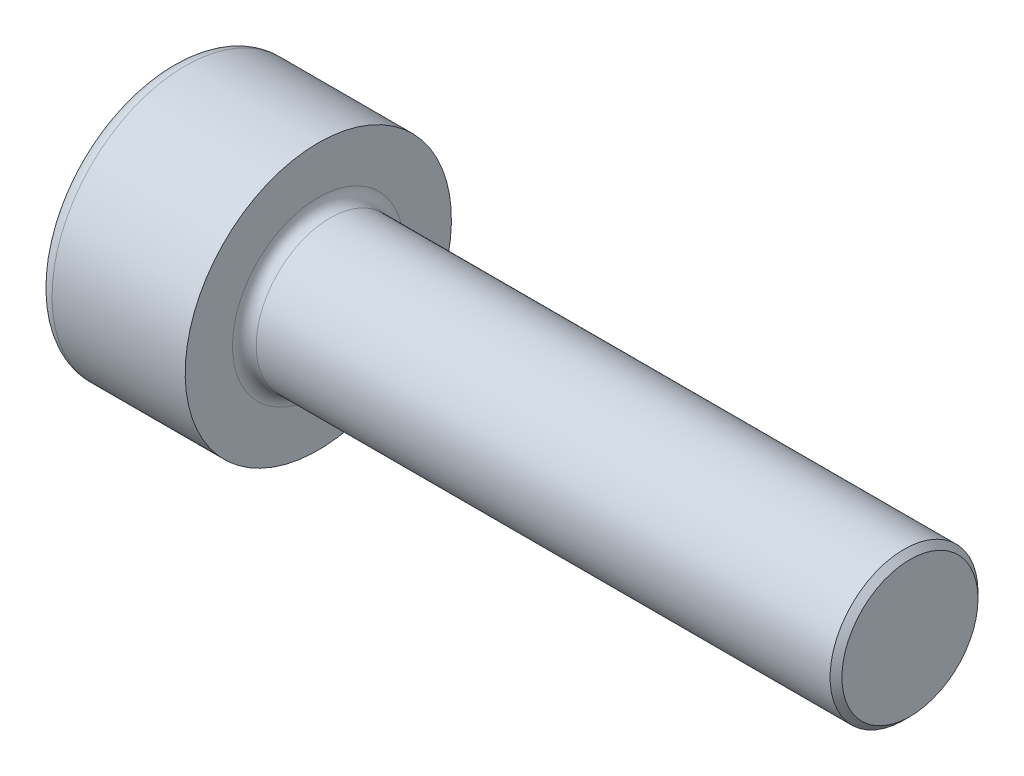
ISO-10303-21;
HEADER;
FILE_DESCRIPTION(('STEP AP214'),'2;1');
FILE_NAME('part.step','',(''),(''),'','','');
FILE_SCHEMA(('AUTOMOTIVE_DESIGN { 1 0 10303 214 1 1 1 1 }'));
ENDSEC;
DATA;
#1=APPLICATION_CONTEXT('core data for automotive mechanical design processes');
#2=APPLICATION_PROTOCOL_DEFINITION('international standard','automotive_design',2000,#1);
#3=PRODUCT_CONTEXT('',#1,'mechanical');
#4=PRODUCT('Part','Part','',(#3));
#5=PRODUCT_RELATED_PRODUCT_CATEGORY('part','',(#4));
#6=PRODUCT_DEFINITION_FORMATION('','',#4);
#7=PRODUCT_DEFINITION_CONTEXT('part definition',#1,'design');
#8=PRODUCT_DEFINITION('design','',#6,#7);
#9=PRODUCT_DEFINITION_SHAPE('','',#8);
#10=(LENGTH_UNIT() NAMED_UNIT(*) SI_UNIT(.MILLI.,.METRE.));
#11=(NAMED_UNIT(*) PLANE_ANGLE_UNIT() SI_UNIT($,.RADIAN.));
#12=(NAMED_UNIT(*) SI_UNIT($,.STERADIAN.) SOLID_ANGLE_UNIT());
#13=UNCERTAINTY_MEASURE_WITH_UNIT(LENGTH_MEASURE(1.E-05),#10,'distance_accuracy_value','');
#14=(GEOMETRIC_REPRESENTATION_CONTEXT(3) GLOBAL_UNCERTAINTY_ASSIGNED_CONTEXT((#13)) GLOBAL_UNIT_ASSIGNED_CONTEXT((#10,
#11,#12)) REPRESENTATION_CONTEXT('',''));
#15=CARTESIAN_POINT('',(0.,0.,0.));
#16=DIRECTION('',(0.,0.,1.));
#17=DIRECTION('',(1.,0.,0.));
#18=AXIS2_PLACEMENT_3D('',#15,#16,#17);
#19=CARTESIAN_POINT('',(0.,1.875,0.));
#20=DIRECTION('',(1.,0.,0.));
#21=DIRECTION('',(0.,1.,0.));
#22=AXIS2_PLACEMENT_3D('',#19,#20,#21);
#23=PLANE('',#22);
#24=CARTESIAN_POINT('',(0.,0.,0.));
#25=DIRECTION('',(1.,0.,0.));
#26=DIRECTION('',(0.,0.,-1.));
#27=AXIS2_PLACEMENT_3D('',#24,#25,#26);
#28=CIRCLE('',#27,1.45);
#29=CARTESIAN_POINT('',(0.,0.,-1.45));
#30=VERTEX_POINT('',#29);
#31=EDGE_CURVE('E132',#30,#30,#28,.F.);
#32=ORIENTED_EDGE('',*,*,#31,.T.);
#33=EDGE_LOOP('',(#32));
#34=FACE_BOUND('',#33,.T.);
#35=CARTESIAN_POINT('',(0.,0.,0.));
#36=DIRECTION('',(1.,0.,0.));
#37=DIRECTION('',(0.,1.,0.));
#38=AXIS2_PLACEMENT_3D('',#35,#36,#37);
#39=CIRCLE('',#38,2.25);
#40=CARTESIAN_POINT('',(0.,2.25,0.));
#41=VERTEX_POINT('',#40);
#42=EDGE_CURVE('E133',#41,#41,#39,.T.);
#43=ORIENTED_EDGE('',*,*,#42,.T.);
#44=EDGE_LOOP('',(#43));
#45=FACE_BOUND('',#44,.T.);
#46=ADVANCED_FACE('F35',(#34,#45),#23,.T.);
#47=CARTESIAN_POINT('',(-1.125,0.,0.));
#48=DIRECTION('',(-1.,0.,0.));
#49=DIRECTION('',(0.,1.,0.));
#50=AXIS2_PLACEMENT_3D('',#47,#48,#49);
#51=CYLINDRICAL_SURFACE('',#50,2.25);
#52=CARTESIAN_POINT('',(-2.25,0.,0.));
#53=DIRECTION('',(1.,0.,0.));
#54=DIRECTION('',(0.,1.,0.));
#55=AXIS2_PLACEMENT_3D('',#52,#53,#54);
#56=CIRCLE('',#55,2.25);
#57=CARTESIAN_POINT('',(-2.25,2.25,0.));
#58=VERTEX_POINT('',#57);
#59=EDGE_CURVE('E50',#58,#58,#56,.T.);
#60=ORIENTED_EDGE('',*,*,#59,.T.);
#61=EDGE_LOOP('',(#60));
#62=FACE_BOUND('',#61,.T.);
#63=ORIENTED_EDGE('',*,*,#42,.F.);
#64=EDGE_LOOP('',(#63));
#65=FACE_BOUND('',#64,.T.);
#66=ADVANCED_FACE('F149',(#62,#65),#51,.T.);
#67=CARTESIAN_POINT('',(-2.25,0.,0.));
#68=DIRECTION('',(1.,0.,0.));
#69=DIRECTION('',(0.,0.,-1.));
#70=AXIS2_PLACEMENT_3D('',#67,#68,#69);
#71=TOROIDAL_SURFACE('',#70,2.,0.25);
#72=CARTESIAN_POINT('',(-2.5,0.,0.));
#73=DIRECTION('',(1.,0.,0.));
#74=DIRECTION('',(0.,1.,0.));
#75=AXIS2_PLACEMENT_3D('',#72,#73,#74);
#76=CIRCLE('',#75,2.);
#77=CARTESIAN_POINT('',(-2.5,2.,0.));
#78=VERTEX_POINT('',#77);
#79=EDGE_CURVE('E315',#78,#78,#76,.T.);
#80=ORIENTED_EDGE('',*,*,#79,.T.);
#81=EDGE_LOOP('',(#80));
#82=FACE_BOUND('',#81,.T.);
#83=ORIENTED_EDGE('',*,*,#59,.F.);
#84=EDGE_LOOP('',(#83));
#85=FACE_BOUND('',#84,.T.);
#86=ADVANCED_FACE('F157',(#82,#85),#71,.T.);
#87=CARTESIAN_POINT('',(-2.5,1.,0.));
#88=DIRECTION('',(-1.,0.,0.));
#89=DIRECTION('',(0.,-1.,0.));
#90=AXIS2_PLACEMENT_3D('',#87,#88,#89);
#91=PLANE('',#90);
#92=ORIENTED_EDGE('',*,*,#79,.F.);
#93=EDGE_LOOP('',(#92));
#94=FACE_BOUND('',#93,.T.);
#95=DIRECTION('',(0.,-0.866025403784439,0.5));
#96=VECTOR('',#95,1.);
#97=CARTESIAN_POINT('',(-2.5,0.875129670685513,0.64974364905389));
#98=LINE('',#97,#96);
#99=CARTESIAN_POINT('',(-2.5,1.00025934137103,0.5775));
#100=VERTEX_POINT('',#99);
#101=CARTESIAN_POINT('',(-2.5,0.,1.155));
#102=VERTEX_POINT('',#101);
#103=EDGE_CURVE('E82',#100,#102,#98,.T.);
#104=ORIENTED_EDGE('',*,*,#103,.T.);
#105=DIRECTION('',(0.,-0.866025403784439,-0.5));
#106=VECTOR('',#105,1.);
#107=CARTESIAN_POINT('',(-2.5,-0.125129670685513,1.08275635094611));
#108=LINE('',#107,#106);
#109=CARTESIAN_POINT('',(-2.5,-1.00025934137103,0.5775));
#110=VERTEX_POINT('',#109);
#111=EDGE_CURVE('E105',#102,#110,#108,.T.);
#112=ORIENTED_EDGE('',*,*,#111,.T.);
#113=DIRECTION('',(0.,0.,-1.));
#114=VECTOR('',#113,1.);
#115=CARTESIAN_POINT('',(-2.5,-1.00025934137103,0.));
#116=LINE('',#115,#114);
#117=CARTESIAN_POINT('',(-2.5,-1.00025934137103,-0.5775));
#118=VERTEX_POINT('',#117);
#119=EDGE_CURVE('E109',#110,#118,#116,.T.);
#120=ORIENTED_EDGE('',*,*,#119,.T.);
#121=DIRECTION('',(0.,0.866025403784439,-0.5));
#122=VECTOR('',#121,1.);
#123=CARTESIAN_POINT('',(-2.5,-0.125129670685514,-1.08275635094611));
#124=LINE('',#123,#122);
#125=CARTESIAN_POINT('',(-2.5,0.,-1.155));
#126=VERTEX_POINT('',#125);
#127=EDGE_CURVE('E286',#118,#126,#124,.T.);
#128=ORIENTED_EDGE('',*,*,#127,.T.);
#129=DIRECTION('',(0.,0.866025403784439,0.5));
#130=VECTOR('',#129,1.);
#131=CARTESIAN_POINT('',(-2.5,0.875129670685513,-0.649743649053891));
#132=LINE('',#131,#130);
#133=CARTESIAN_POINT('',(-2.5,1.00025934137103,-0.5775));
#134=VERTEX_POINT('',#133);
#135=EDGE_CURVE('E298',#126,#134,#132,.T.);
#136=ORIENTED_EDGE('',*,*,#135,.T.);
#137=DIRECTION('',(0.,0.,1.));
#138=VECTOR('',#137,1.);
#139=CARTESIAN_POINT('',(-2.5,1.00025934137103,0.));
#140=LINE('',#139,#138);
#141=EDGE_CURVE('E304',#134,#100,#140,.T.);
#142=ORIENTED_EDGE('',*,*,#141,.T.);
#143=EDGE_LOOP('',(#104,#112,#120,#128,#136,#142));
#144=FACE_BOUND('',#143,.T.);
#145=ADVANCED_FACE('F106',(#94,#144),#91,.T.);
#146=CARTESIAN_POINT('',(-1.06758021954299,0.,0.));
#147=DIRECTION('',(-1.,0.,0.));
#148=DIRECTION('',(0.,1.,0.));
#149=AXIS2_PLACEMENT_3D('',#146,#147,#148);
#150=CONICAL_SURFACE('',#149,0.5775,1.0471975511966);
#151=CARTESIAN_POINT('',(-0.734160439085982,0.,0.));
#152=VERTEX_POINT('',#151);
#153=VERTEX_LOOP('',#152);
#154=FACE_BOUND('',#153,.T.);
#155=CARTESIAN_POINT('',(-1.401,-1.00025934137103,-0.5775));
#156=CARTESIAN_POINT('',(-1.2342901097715,-1.00025934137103,0.));
#157=CARTESIAN_POINT('',(-1.401,-1.00025934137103,0.5775));
#158=(BOUNDED_CURVE() B_SPLINE_CURVE(2,(#155,#156,#157),.UNSPECIFIED.,.F.,
.F.) B_SPLINE_CURVE_WITH_KNOTS((3,3),(0.,1.16873916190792),
.UNSPECIFIED.) CURVE() GEOMETRIC_REPRESENTATION_ITEM() RATIONAL_B_SPLINE_CURVE((1.,
1.15470053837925,1.)) REPRESENTATION_ITEM(''));
#159=CARTESIAN_POINT('',(-1.401,-1.00025934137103,-0.5775));
#160=VERTEX_POINT('',#159);
#161=CARTESIAN_POINT('',(-1.401,-1.00025934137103,0.5775));
#162=VERTEX_POINT('',#161);
#163=EDGE_CURVE('E118',#160,#162,#158,.T.);
#164=ORIENTED_EDGE('',*,*,#163,.T.);
#165=CARTESIAN_POINT('',(-1.401,-1.00025934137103,0.5775));
#166=CARTESIAN_POINT('',(-1.23429010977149,-0.500129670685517,0.86625));
#167=CARTESIAN_POINT('',(-1.401,0.,1.155));
#168=(BOUNDED_CURVE() B_SPLINE_CURVE(2,(#165,#166,#167),.UNSPECIFIED.,.F.,
.F.) B_SPLINE_CURVE_WITH_KNOTS((3,3),(0.,1.16873916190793),
.UNSPECIFIED.) CURVE() GEOMETRIC_REPRESENTATION_ITEM() RATIONAL_B_SPLINE_CURVE((1.,
1.15470053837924,1.)) REPRESENTATION_ITEM(''));
#169=CARTESIAN_POINT('',(-1.401,0.,1.155));
#170=VERTEX_POINT('',#169);
#171=EDGE_CURVE('E101',#162,#170,#168,.T.);
#172=ORIENTED_EDGE('',*,*,#171,.T.);
#173=CARTESIAN_POINT('',(-1.401,0.,1.155));
#174=CARTESIAN_POINT('',(-1.2342901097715,0.500129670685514,0.866250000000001));
#175=CARTESIAN_POINT('',(-1.401,1.00025934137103,0.5775));
#176=(BOUNDED_CURVE() B_SPLINE_CURVE(2,(#173,#174,#175),.UNSPECIFIED.,.F.,
.F.) B_SPLINE_CURVE_WITH_KNOTS((3,3),(0.,1.16873916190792),
.UNSPECIFIED.) CURVE() GEOMETRIC_REPRESENTATION_ITEM() RATIONAL_B_SPLINE_CURVE((1.,
1.15470053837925,1.)) REPRESENTATION_ITEM(''));
#177=CARTESIAN_POINT('',(-1.401,1.00025934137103,0.5775));
#178=VERTEX_POINT('',#177);
#179=EDGE_CURVE('E306',#170,#178,#176,.T.);
#180=ORIENTED_EDGE('',*,*,#179,.T.);
#181=CARTESIAN_POINT('',(-1.401,1.00025934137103,0.5775));
#182=CARTESIAN_POINT('',(-1.23429010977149,1.00025934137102,0.));
#183=CARTESIAN_POINT('',(-1.401,1.00025934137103,-0.5775));
#184=(BOUNDED_CURVE() B_SPLINE_CURVE(2,(#181,#182,#183),.UNSPECIFIED.,.F.,
.F.) B_SPLINE_CURVE_WITH_KNOTS((3,3),(0.,1.16873916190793),
.UNSPECIFIED.) CURVE() GEOMETRIC_REPRESENTATION_ITEM() RATIONAL_B_SPLINE_CURVE((1.,
1.15470053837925,1.)) REPRESENTATION_ITEM(''));
#185=CARTESIAN_POINT('',(-1.401,1.00025934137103,-0.5775));
#186=VERTEX_POINT('',#185);
#187=EDGE_CURVE('E88',#178,#186,#184,.T.);
#188=ORIENTED_EDGE('',*,*,#187,.T.);
#189=CARTESIAN_POINT('',(-1.401,1.00025934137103,-0.5775));
#190=CARTESIAN_POINT('',(-1.2342901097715,0.500129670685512,-0.866250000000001));
#191=CARTESIAN_POINT('',(-1.401,0.,-1.155));
#192=(BOUNDED_CURVE() B_SPLINE_CURVE(2,(#189,#190,#191),.UNSPECIFIED.,.F.,
.F.) B_SPLINE_CURVE_WITH_KNOTS((3,3),(0.,1.16873916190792),
.UNSPECIFIED.) CURVE() GEOMETRIC_REPRESENTATION_ITEM() RATIONAL_B_SPLINE_CURVE((1.,
1.15470053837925,1.)) REPRESENTATION_ITEM(''));
#193=CARTESIAN_POINT('',(-1.401,0.,-1.155));
#194=VERTEX_POINT('',#193);
#195=EDGE_CURVE('E300',#186,#194,#192,.T.);
#196=ORIENTED_EDGE('',*,*,#195,.T.);
#197=CARTESIAN_POINT('',(-1.401,0.,-1.155));
#198=CARTESIAN_POINT('',(-1.2342901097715,-0.500129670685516,-0.86625));
#199=CARTESIAN_POINT('',(-1.401,-1.00025934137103,-0.5775));
#200=(BOUNDED_CURVE() B_SPLINE_CURVE(2,(#197,#198,#199),.UNSPECIFIED.,.F.,
.F.) B_SPLINE_CURVE_WITH_KNOTS((3,3),(0.,1.16873916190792),
.UNSPECIFIED.) CURVE() GEOMETRIC_REPRESENTATION_ITEM() RATIONAL_B_SPLINE_CURVE((1.,
1.15470053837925,1.)) REPRESENTATION_ITEM(''));
#201=EDGE_CURVE('E292',#194,#160,#200,.T.);
#202=ORIENTED_EDGE('',*,*,#201,.T.);
#203=EDGE_LOOP('',(#164,#172,#180,#188,#196,#202));
#204=FACE_BOUND('',#203,.T.);
#205=ADVANCED_FACE('F170',(#154,#204),#150,.F.);
#206=CARTESIAN_POINT('',(-2.501,-0.500129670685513,0.86625));
#207=DIRECTION('',(0.,-0.5,0.866025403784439));
#208=DIRECTION('',(0.,-0.866025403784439,-0.5));
#209=AXIS2_PLACEMENT_3D('',#206,#207,#208);
#210=PLANE('',#209);
#211=ORIENTED_EDGE('',*,*,#111,.F.);
#212=DIRECTION('',(1.,0.,0.));
#213=VECTOR('',#212,1.);
#214=CARTESIAN_POINT('',(-1.951,0.,1.155));
#215=LINE('',#214,#213);
#216=EDGE_CURVE('E112',#102,#170,#215,.T.);
#217=ORIENTED_EDGE('',*,*,#216,.T.);
#218=ORIENTED_EDGE('',*,*,#171,.F.);
#219=DIRECTION('',(-1.,0.,0.));
#220=VECTOR('',#219,1.);
#221=CARTESIAN_POINT('',(-1.951,-1.00025934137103,0.5775));
#222=LINE('',#221,#220);
#223=EDGE_CURVE('E115',#162,#110,#222,.T.);
#224=ORIENTED_EDGE('',*,*,#223,.T.);
#225=EDGE_LOOP('',(#211,#217,#218,#224));
#226=FACE_BOUND('',#225,.T.);
#227=ADVANCED_FACE('F116',(#226),#210,.F.);
#228=CARTESIAN_POINT('',(-2.501,0.500129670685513,0.86625));
#229=DIRECTION('',(0.,0.5,0.866025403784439));
#230=DIRECTION('',(0.,-0.866025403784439,0.5));
#231=AXIS2_PLACEMENT_3D('',#228,#229,#230);
#232=PLANE('',#231);
#233=ORIENTED_EDGE('',*,*,#103,.F.);
#234=DIRECTION('',(-1.,0.,0.));
#235=VECTOR('',#234,1.);
#236=CARTESIAN_POINT('',(-1.951,1.00025934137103,0.5775));
#237=LINE('',#236,#235);
#238=EDGE_CURVE('E124',#178,#100,#237,.T.);
#239=ORIENTED_EDGE('',*,*,#238,.F.);
#240=ORIENTED_EDGE('',*,*,#179,.F.);
#241=ORIENTED_EDGE('',*,*,#216,.F.);
#242=EDGE_LOOP('',(#233,#239,#240,#241));
#243=FACE_BOUND('',#242,.T.);
#244=ADVANCED_FACE('F169',(#243),#232,.F.);
#245=CARTESIAN_POINT('',(-2.501,-1.00025934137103,0.));
#246=DIRECTION('',(0.,-1.,0.));
#247=DIRECTION('',(0.,0.,-1.));
#248=AXIS2_PLACEMENT_3D('',#245,#246,#247);
#249=PLANE('',#248);
#250=ORIENTED_EDGE('',*,*,#119,.F.);
#251=ORIENTED_EDGE('',*,*,#223,.F.);
#252=ORIENTED_EDGE('',*,*,#163,.F.);
#253=DIRECTION('',(-1.,0.,0.));
#254=VECTOR('',#253,1.);
#255=CARTESIAN_POINT('',(-1.951,-1.00025934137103,-0.5775));
#256=LINE('',#255,#254);
#257=EDGE_CURVE('E122',#160,#118,#256,.T.);
#258=ORIENTED_EDGE('',*,*,#257,.T.);
#259=EDGE_LOOP('',(#250,#251,#252,#258));
#260=FACE_BOUND('',#259,.T.);
#261=ADVANCED_FACE('F120',(#260),#249,.F.);
#262=CARTESIAN_POINT('',(-2.501,1.00025934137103,0.));
#263=DIRECTION('',(0.,1.,0.));
#264=DIRECTION('',(0.,0.,1.));
#265=AXIS2_PLACEMENT_3D('',#262,#263,#264);
#266=PLANE('',#265);
#267=ORIENTED_EDGE('',*,*,#141,.F.);
#268=DIRECTION('',(-1.,0.,0.));
#269=VECTOR('',#268,1.);
#270=CARTESIAN_POINT('',(-1.951,1.00025934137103,-0.5775));
#271=LINE('',#270,#269);
#272=EDGE_CURVE('E301',#186,#134,#271,.T.);
#273=ORIENTED_EDGE('',*,*,#272,.F.);
#274=ORIENTED_EDGE('',*,*,#187,.F.);
#275=ORIENTED_EDGE('',*,*,#238,.T.);
#276=EDGE_LOOP('',(#267,#273,#274,#275));
#277=FACE_BOUND('',#276,.T.);
#278=ADVANCED_FACE('F165',(#277),#266,.F.);
#279=CARTESIAN_POINT('',(-2.501,0.500129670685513,-0.86625));
#280=DIRECTION('',(0.,0.5,-0.866025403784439));
#281=DIRECTION('',(0.,0.866025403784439,0.5));
#282=AXIS2_PLACEMENT_3D('',#279,#280,#281);
#283=PLANE('',#282);
#284=ORIENTED_EDGE('',*,*,#135,.F.);
#285=DIRECTION('',(-1.,0.,0.));
#286=VECTOR('',#285,1.);
#287=CARTESIAN_POINT('',(-1.951,0.,-1.155));
#288=LINE('',#287,#286);
#289=EDGE_CURVE('E289',#194,#126,#288,.T.);
#290=ORIENTED_EDGE('',*,*,#289,.F.);
#291=ORIENTED_EDGE('',*,*,#195,.F.);
#292=ORIENTED_EDGE('',*,*,#272,.T.);
#293=EDGE_LOOP('',(#284,#290,#291,#292));
#294=FACE_BOUND('',#293,.T.);
#295=ADVANCED_FACE('F161',(#294),#283,.F.);
#296=CARTESIAN_POINT('',(-2.501,-0.500129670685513,-0.86625));
#297=DIRECTION('',(0.,-0.5,-0.866025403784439));
#298=DIRECTION('',(0.,0.866025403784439,-0.5));
#299=AXIS2_PLACEMENT_3D('',#296,#297,#298);
#300=PLANE('',#299);
#301=ORIENTED_EDGE('',*,*,#127,.F.);
#302=ORIENTED_EDGE('',*,*,#257,.F.);
#303=ORIENTED_EDGE('',*,*,#201,.F.);
#304=ORIENTED_EDGE('',*,*,#289,.T.);
#305=EDGE_LOOP('',(#301,#302,#303,#304));
#306=FACE_BOUND('',#305,.T.);
#307=ADVANCED_FACE('F164',(#306),#300,.F.);
#308=CARTESIAN_POINT('',(10.,0.,0.));
#309=DIRECTION('',(-1.,0.,0.));
#310=DIRECTION('',(0.,0.,1.));
#311=AXIS2_PLACEMENT_3D('',#308,#309,#310);
#312=CYLINDRICAL_SURFACE('',#311,1.25);
#313=CARTESIAN_POINT('',(9.9,0.,0.));
#314=DIRECTION('',(1.,0.,0.));
#315=DIRECTION('',(0.,0.,-1.));
#316=AXIS2_PLACEMENT_3D('',#313,#314,#315);
#317=CIRCLE('',#316,1.25);
#318=CARTESIAN_POINT('',(9.9,0.,-1.25));
#319=VERTEX_POINT('',#318);
#320=EDGE_CURVE('E11',#319,#319,#317,.F.);
#321=ORIENTED_EDGE('',*,*,#320,.T.);
#322=EDGE_LOOP('',(#321));
#323=FACE_BOUND('',#322,.T.);
#324=CARTESIAN_POINT('',(0.200000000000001,0.,0.));
#325=DIRECTION('',(1.,0.,0.));
#326=DIRECTION('',(0.,0.,-1.));
#327=AXIS2_PLACEMENT_3D('',#324,#325,#326);
#328=CIRCLE('',#327,1.25);
#329=CARTESIAN_POINT('',(0.200000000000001,0.,-1.25));
#330=VERTEX_POINT('',#329);
#331=EDGE_CURVE('E129',#330,#330,#328,.T.);
#332=ORIENTED_EDGE('',*,*,#331,.T.);
#333=EDGE_LOOP('',(#332));
#334=FACE_BOUND('',#333,.T.);
#335=ADVANCED_FACE('F187',(#323,#334),#312,.T.);
#336=CARTESIAN_POINT('',(10.,0.,0.));
#337=DIRECTION('',(1.,0.,0.));
#338=DIRECTION('',(0.,0.,-1.));
#339=AXIS2_PLACEMENT_3D('',#336,#337,#338);
#340=PLANE('',#339);
#341=CARTESIAN_POINT('',(10.,0.,0.));
#342=DIRECTION('',(1.,0.,0.));
#343=DIRECTION('',(0.,0.,-1.));
#344=AXIS2_PLACEMENT_3D('',#341,#342,#343);
#345=CIRCLE('',#344,1.15);
#346=CARTESIAN_POINT('',(10.,0.,-1.15));
#347=VERTEX_POINT('',#346);
#348=EDGE_CURVE('E44',#347,#347,#345,.T.);
#349=ORIENTED_EDGE('',*,*,#348,.T.);
#350=EDGE_LOOP('',(#349));
#351=FACE_BOUND('',#350,.T.);
#352=ADVANCED_FACE('F138',(#351),#340,.T.);
#353=CARTESIAN_POINT('',(0.200000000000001,0.,0.));
#354=DIRECTION('',(1.,0.,0.));
#355=DIRECTION('',(0.,0.,-1.));
#356=AXIS2_PLACEMENT_3D('',#353,#354,#355);
#357=TOROIDAL_SURFACE('',#356,1.45,0.2);
#358=ORIENTED_EDGE('',*,*,#31,.F.);
#359=EDGE_LOOP('',(#358));
#360=FACE_BOUND('',#359,.T.);
#361=ORIENTED_EDGE('',*,*,#331,.F.);
#362=EDGE_LOOP('',(#361));
#363=FACE_BOUND('',#362,.T.);
#364=ADVANCED_FACE('F141',(#360,#363),#357,.F.);
#365=CARTESIAN_POINT('',(10.,0.,0.));
#366=DIRECTION('',(-1.,0.,0.));
#367=DIRECTION('',(0.,0.,1.));
#368=AXIS2_PLACEMENT_3D('',#365,#366,#367);
#369=CONICAL_SURFACE('',#368,1.15,0.78539816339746);
#370=ORIENTED_EDGE('',*,*,#320,.F.);
#371=EDGE_LOOP('',(#370));
#372=FACE_BOUND('',#371,.T.);
#373=ORIENTED_EDGE('',*,*,#348,.F.);
#374=EDGE_LOOP('',(#373));
#375=FACE_BOUND('',#374,.T.);
#376=ADVANCED_FACE('F37',(#372,#375),#369,.T.);
#377=CLOSED_SHELL('',(#46,#66,#86,#145,#205,#227,#244,#261,#278,#295,#307,#335,#352,#364,#376));
#378=MANIFOLD_SOLID_BREP('B2',#377);
#379=ADVANCED_BREP_SHAPE_REPRESENTATION('',(#18,#378),#14);
#380=SHAPE_DEFINITION_REPRESENTATION(#9,#379);
ENDSEC;
END-ISO-10303-21;
